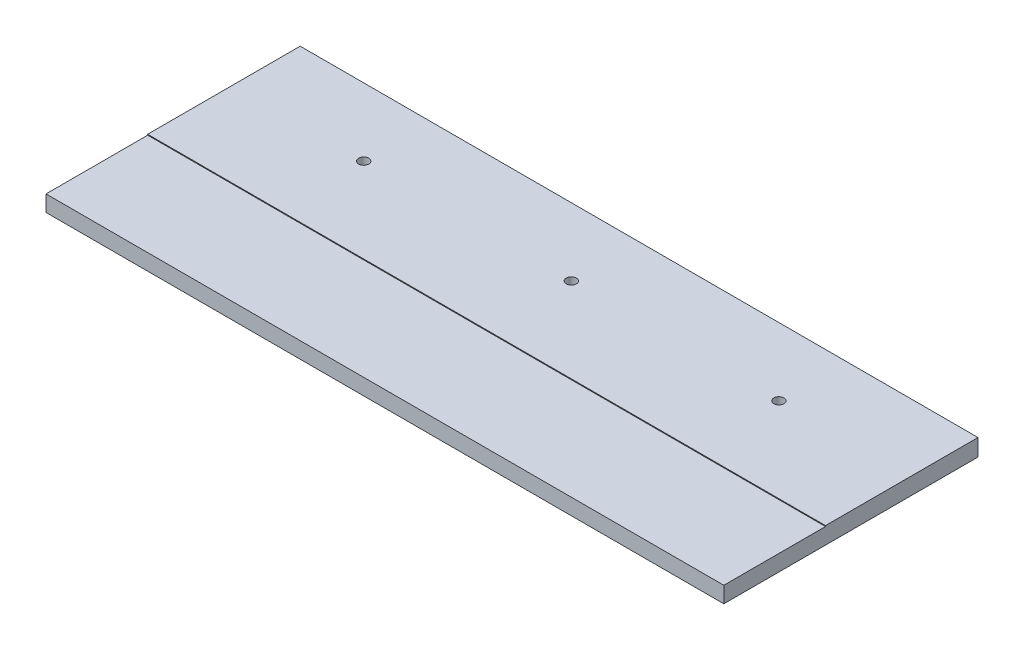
from build123d import *

# Parameters (mm, degrees)
ESQUISSE1_W             = 800
ESQUISSE1_H             = 300
ESQUISSE1_R             = 6
EXTRUSION1_DEPTH        = 20
ESQUISSE2_W             = 800
ESQUISSE2_H             = 120
ENL_V_MAT_EXTRU_1_DEPTH = 1


with BuildPart() as part:
    # Esquisse1 → Extrusion1 (new body)
    with BuildSketch(Plane(origin=(0, 0, 0), x_dir=(1, 0, 0), z_dir=(0, 1, 0))):
        Rectangle(ESQUISSE1_W, ESQUISSE1_H)
        with Locations(Location((0, 70, 0), (0, 0, 270))):
            Circle(ESQUISSE1_R, mode=Mode.SUBTRACT)
        with Locations(Location((245, 70, 0), (0, 0, 270))):
            Circle(ESQUISSE1_R, mode=Mode.SUBTRACT)
        with Locations(Location((-245, 70, 0), (0, 0, 90))):
            Circle(ESQUISSE1_R, mode=Mode.SUBTRACT)
    extrude(amount=EXTRUSION1_DEPTH)

    # Esquisse2 → Enl_v. mat.-Extru.1 (cut)
    with BuildSketch(Plane(origin=(0, 20, 0), x_dir=(-1, 0, 0), z_dir=(0, 1, 0))):
        with Locations((0, 90)):
            Rectangle(ESQUISSE2_W, ESQUISSE2_H)
    extrude(amount=-ENL_V_MAT_EXTRU_1_DEPTH, mode=Mode.SUBTRACT)


solid = part.part
